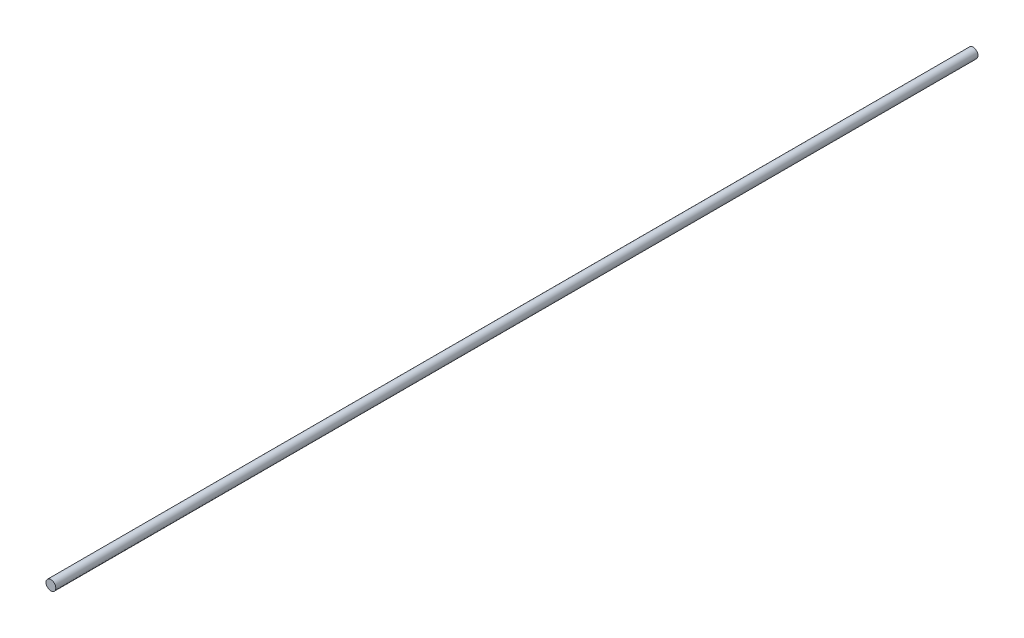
from build123d import *

# Parameters (mm, degrees)
SKETCH1_R           = 30
BOSS_EXTRUDE1_DEPTH = 5650


with BuildPart() as part:
    # Sketch1 → Boss-Extrude1 (new body)
    with BuildSketch(Plane.XY):
        Circle(SKETCH1_R)
    extrude(amount=-BOSS_EXTRUDE1_DEPTH)


solid = part.part
